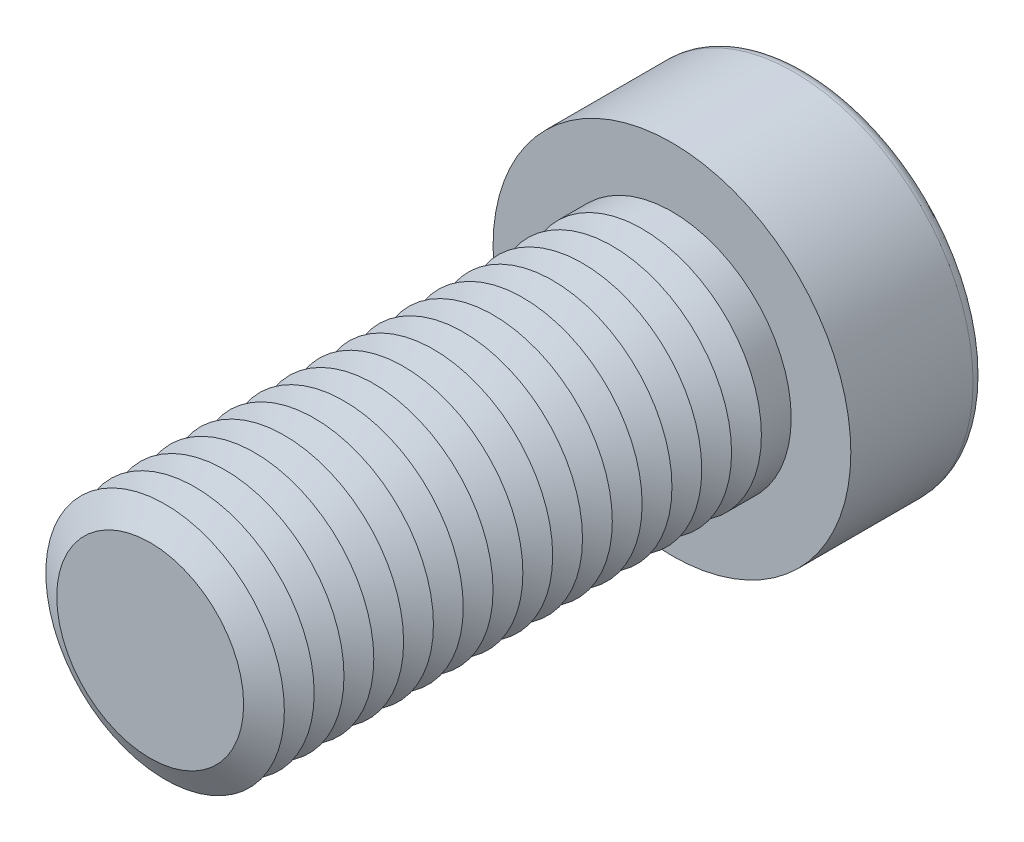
ISO-10303-21;
HEADER;
FILE_DESCRIPTION(('STEP AP214'),'2;1');
FILE_NAME('part.step','',(''),(''),'','','');
FILE_SCHEMA(('AUTOMOTIVE_DESIGN { 1 0 10303 214 1 1 1 1 }'));
ENDSEC;
DATA;
#1=APPLICATION_CONTEXT('core data for automotive mechanical design processes');
#2=APPLICATION_PROTOCOL_DEFINITION('international standard','automotive_design',2000,#1);
#3=PRODUCT_CONTEXT('',#1,'mechanical');
#4=PRODUCT('Part','Part','',(#3));
#5=PRODUCT_RELATED_PRODUCT_CATEGORY('part','',(#4));
#6=PRODUCT_DEFINITION_FORMATION('','',#4);
#7=PRODUCT_DEFINITION_CONTEXT('part definition',#1,'design');
#8=PRODUCT_DEFINITION('design','',#6,#7);
#9=PRODUCT_DEFINITION_SHAPE('','',#8);
#10=(LENGTH_UNIT() NAMED_UNIT(*) SI_UNIT(.MILLI.,.METRE.));
#11=(NAMED_UNIT(*) PLANE_ANGLE_UNIT() SI_UNIT($,.RADIAN.));
#12=(NAMED_UNIT(*) SI_UNIT($,.STERADIAN.) SOLID_ANGLE_UNIT());
#13=UNCERTAINTY_MEASURE_WITH_UNIT(LENGTH_MEASURE(1.E-05),#10,'distance_accuracy_value','');
#14=(GEOMETRIC_REPRESENTATION_CONTEXT(3) GLOBAL_UNCERTAINTY_ASSIGNED_CONTEXT((#13)) GLOBAL_UNIT_ASSIGNED_CONTEXT((#10,
#11,#12)) REPRESENTATION_CONTEXT('',''));
#15=CARTESIAN_POINT('',(0.,0.,0.));
#16=DIRECTION('',(0.,0.,1.));
#17=DIRECTION('',(1.,0.,0.));
#18=AXIS2_PLACEMENT_3D('',#15,#16,#17);
#19=CARTESIAN_POINT('',(0.,0.,28.));
#20=DIRECTION('',(0.,0.,1.));
#21=DIRECTION('',(1.,0.,0.));
#22=AXIS2_PLACEMENT_3D('',#19,#20,#21);
#23=CONICAL_SURFACE('',#22,8.,1.0471975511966);
#24=CARTESIAN_POINT('',(0.,0.,27.));
#25=DIRECTION('',(0.,0.,1.));
#26=DIRECTION('',(1.,0.,0.));
#27=AXIS2_PLACEMENT_3D('',#24,#25,#26);
#28=CIRCLE('',#27,6.26794919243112);
#29=CARTESIAN_POINT('',(6.26794919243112,0.,27.));
#30=VERTEX_POINT('',#29);
#31=EDGE_CURVE('E314',#30,#30,#28,.T.);
#32=ORIENTED_EDGE('',*,*,#31,.T.);
#33=EDGE_LOOP('',(#32));
#34=FACE_BOUND('',#33,.T.);
#35=CARTESIAN_POINT('',(0.,0.,28.));
#36=DIRECTION('',(0.,0.,1.));
#37=DIRECTION('',(1.,0.,0.));
#38=AXIS2_PLACEMENT_3D('',#35,#36,#37);
#39=CIRCLE('',#38,8.);
#40=CARTESIAN_POINT('',(8.,0.,28.));
#41=VERTEX_POINT('',#40);
#42=EDGE_CURVE('E317',#41,#41,#39,.T.);
#43=ORIENTED_EDGE('',*,*,#42,.F.);
#44=EDGE_LOOP('',(#43));
#45=FACE_BOUND('',#44,.T.);
#46=ADVANCED_FACE('F39',(#34,#45),#23,.T.);
#47=CARTESIAN_POINT('',(0.,0.,27.));
#48=DIRECTION('',(0.,0.,-1.));
#49=DIRECTION('',(-1.,0.,0.));
#50=AXIS2_PLACEMENT_3D('',#47,#48,#49);
#51=CONICAL_SURFACE('',#50,6.26794919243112,1.0471975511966);
#52=CARTESIAN_POINT('',(0.,0.,26.));
#53=DIRECTION('',(0.,0.,1.));
#54=DIRECTION('',(1.,0.,0.));
#55=AXIS2_PLACEMENT_3D('',#52,#53,#54);
#56=CIRCLE('',#55,8.);
#57=CARTESIAN_POINT('',(8.,0.,26.));
#58=VERTEX_POINT('',#57);
#59=EDGE_CURVE('E325',#58,#58,#56,.T.);
#60=ORIENTED_EDGE('',*,*,#59,.T.);
#61=EDGE_LOOP('',(#60));
#62=FACE_BOUND('',#61,.T.);
#63=ORIENTED_EDGE('',*,*,#31,.F.);
#64=EDGE_LOOP('',(#63));
#65=FACE_BOUND('',#64,.T.);
#66=ADVANCED_FACE('F245',(#62,#65),#51,.T.);
#67=CARTESIAN_POINT('',(0.,0.,35.));
#68=DIRECTION('',(0.,0.,1.));
#69=DIRECTION('',(1.,0.,0.));
#70=AXIS2_PLACEMENT_3D('',#67,#68,#69);
#71=PLANE('',#70);
#72=CARTESIAN_POINT('',(0.,0.,35.));
#73=DIRECTION('',(0.,0.,1.));
#74=DIRECTION('',(1.,0.,0.));
#75=AXIS2_PLACEMENT_3D('',#72,#73,#74);
#76=CIRCLE('',#75,6.26794919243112);
#77=CARTESIAN_POINT('',(6.26794919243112,0.,35.));
#78=VERTEX_POINT('',#77);
#79=EDGE_CURVE('E174',#78,#78,#76,.T.);
#80=ORIENTED_EDGE('',*,*,#79,.T.);
#81=EDGE_LOOP('',(#80));
#82=FACE_BOUND('',#81,.T.);
#83=ADVANCED_FACE('F251',(#82),#71,.T.);
#84=CARTESIAN_POINT('',(0.,0.,35.));
#85=DIRECTION('',(0.,0.,-1.));
#86=DIRECTION('',(-1.,0.,0.));
#87=AXIS2_PLACEMENT_3D('',#84,#85,#86);
#88=CONICAL_SURFACE('',#87,6.26794919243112,1.0471975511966);
#89=CARTESIAN_POINT('',(0.,0.,34.));
#90=DIRECTION('',(0.,0.,1.));
#91=DIRECTION('',(1.,0.,0.));
#92=AXIS2_PLACEMENT_3D('',#89,#90,#91);
#93=CIRCLE('',#92,8.);
#94=CARTESIAN_POINT('',(8.,0.,34.));
#95=VERTEX_POINT('',#94);
#96=EDGE_CURVE('E291',#95,#95,#93,.T.);
#97=ORIENTED_EDGE('',*,*,#96,.T.);
#98=EDGE_LOOP('',(#97));
#99=FACE_BOUND('',#98,.T.);
#100=ORIENTED_EDGE('',*,*,#79,.F.);
#101=EDGE_LOOP('',(#100));
#102=FACE_BOUND('',#101,.T.);
#103=ADVANCED_FACE('F199',(#99,#102),#88,.T.);
#104=CARTESIAN_POINT('',(0.,0.,34.));
#105=DIRECTION('',(0.,0.,1.));
#106=DIRECTION('',(1.,0.,0.));
#107=AXIS2_PLACEMENT_3D('',#104,#105,#106);
#108=CONICAL_SURFACE('',#107,8.,1.0471975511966);
#109=CARTESIAN_POINT('',(0.,0.,33.));
#110=DIRECTION('',(0.,0.,1.));
#111=DIRECTION('',(1.,0.,0.));
#112=AXIS2_PLACEMENT_3D('',#109,#110,#111);
#113=CIRCLE('',#112,6.26794919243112);
#114=CARTESIAN_POINT('',(6.26794919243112,0.,33.));
#115=VERTEX_POINT('',#114);
#116=EDGE_CURVE('E288',#115,#115,#113,.T.);
#117=ORIENTED_EDGE('',*,*,#116,.T.);
#118=EDGE_LOOP('',(#117));
#119=FACE_BOUND('',#118,.T.);
#120=ORIENTED_EDGE('',*,*,#96,.F.);
#121=EDGE_LOOP('',(#120));
#122=FACE_BOUND('',#121,.T.);
#123=ADVANCED_FACE('F277',(#119,#122),#108,.T.);
#124=CARTESIAN_POINT('',(0.,0.,33.));
#125=DIRECTION('',(0.,0.,-1.));
#126=DIRECTION('',(-1.,0.,0.));
#127=AXIS2_PLACEMENT_3D('',#124,#125,#126);
#128=CONICAL_SURFACE('',#127,6.26794919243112,1.0471975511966);
#129=CARTESIAN_POINT('',(0.,0.,32.));
#130=DIRECTION('',(0.,0.,1.));
#131=DIRECTION('',(1.,0.,0.));
#132=AXIS2_PLACEMENT_3D('',#129,#130,#131);
#133=CIRCLE('',#132,8.);
#134=CARTESIAN_POINT('',(8.,0.,32.));
#135=VERTEX_POINT('',#134);
#136=EDGE_CURVE('E300',#135,#135,#133,.T.);
#137=ORIENTED_EDGE('',*,*,#136,.T.);
#138=EDGE_LOOP('',(#137));
#139=FACE_BOUND('',#138,.T.);
#140=ORIENTED_EDGE('',*,*,#116,.F.);
#141=EDGE_LOOP('',(#140));
#142=FACE_BOUND('',#141,.T.);
#143=ADVANCED_FACE('F274',(#139,#142),#128,.T.);
#144=CARTESIAN_POINT('',(0.,0.,32.));
#145=DIRECTION('',(0.,0.,1.));
#146=DIRECTION('',(1.,0.,0.));
#147=AXIS2_PLACEMENT_3D('',#144,#145,#146);
#148=CONICAL_SURFACE('',#147,8.,1.0471975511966);
#149=CARTESIAN_POINT('',(0.,0.,31.));
#150=DIRECTION('',(0.,0.,1.));
#151=DIRECTION('',(1.,0.,0.));
#152=AXIS2_PLACEMENT_3D('',#149,#150,#151);
#153=CIRCLE('',#152,6.26794919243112);
#154=CARTESIAN_POINT('',(6.26794919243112,0.,31.));
#155=VERTEX_POINT('',#154);
#156=EDGE_CURVE('E293',#155,#155,#153,.T.);
#157=ORIENTED_EDGE('',*,*,#156,.T.);
#158=EDGE_LOOP('',(#157));
#159=FACE_BOUND('',#158,.T.);
#160=ORIENTED_EDGE('',*,*,#136,.F.);
#161=EDGE_LOOP('',(#160));
#162=FACE_BOUND('',#161,.T.);
#163=ADVANCED_FACE('F270',(#159,#162),#148,.T.);
#164=CARTESIAN_POINT('',(0.,0.,31.));
#165=DIRECTION('',(0.,0.,-1.));
#166=DIRECTION('',(-1.,0.,0.));
#167=AXIS2_PLACEMENT_3D('',#164,#165,#166);
#168=CONICAL_SURFACE('',#167,6.26794919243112,1.0471975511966);
#169=CARTESIAN_POINT('',(0.,0.,30.));
#170=DIRECTION('',(0.,0.,1.));
#171=DIRECTION('',(1.,0.,0.));
#172=AXIS2_PLACEMENT_3D('',#169,#170,#171);
#173=CIRCLE('',#172,8.);
#174=CARTESIAN_POINT('',(8.,0.,30.));
#175=VERTEX_POINT('',#174);
#176=EDGE_CURVE('E310',#175,#175,#173,.T.);
#177=ORIENTED_EDGE('',*,*,#176,.T.);
#178=EDGE_LOOP('',(#177));
#179=FACE_BOUND('',#178,.T.);
#180=ORIENTED_EDGE('',*,*,#156,.F.);
#181=EDGE_LOOP('',(#180));
#182=FACE_BOUND('',#181,.T.);
#183=ADVANCED_FACE('F266',(#179,#182),#168,.T.);
#184=CARTESIAN_POINT('',(0.,0.,30.));
#185=DIRECTION('',(0.,0.,1.));
#186=DIRECTION('',(1.,0.,0.));
#187=AXIS2_PLACEMENT_3D('',#184,#185,#186);
#188=CONICAL_SURFACE('',#187,8.,1.0471975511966);
#189=CARTESIAN_POINT('',(0.,0.,29.));
#190=DIRECTION('',(0.,0.,1.));
#191=DIRECTION('',(1.,0.,0.));
#192=AXIS2_PLACEMENT_3D('',#189,#190,#191);
#193=CIRCLE('',#192,6.26794919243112);
#194=CARTESIAN_POINT('',(6.26794919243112,0.,29.));
#195=VERTEX_POINT('',#194);
#196=EDGE_CURVE('E306',#195,#195,#193,.T.);
#197=ORIENTED_EDGE('',*,*,#196,.T.);
#198=EDGE_LOOP('',(#197));
#199=FACE_BOUND('',#198,.T.);
#200=ORIENTED_EDGE('',*,*,#176,.F.);
#201=EDGE_LOOP('',(#200));
#202=FACE_BOUND('',#201,.T.);
#203=ADVANCED_FACE('F262',(#199,#202),#188,.T.);
#204=CARTESIAN_POINT('',(0.,0.,29.));
#205=DIRECTION('',(0.,0.,-1.));
#206=DIRECTION('',(-1.,0.,0.));
#207=AXIS2_PLACEMENT_3D('',#204,#205,#206);
#208=CONICAL_SURFACE('',#207,6.26794919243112,1.0471975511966);
#209=ORIENTED_EDGE('',*,*,#42,.T.);
#210=EDGE_LOOP('',(#209));
#211=FACE_BOUND('',#210,.T.);
#212=ORIENTED_EDGE('',*,*,#196,.F.);
#213=EDGE_LOOP('',(#212));
#214=FACE_BOUND('',#213,.T.);
#215=ADVANCED_FACE('F258',(#211,#214),#208,.T.);
#216=CARTESIAN_POINT('',(0.,0.,26.));
#217=DIRECTION('',(0.,0.,1.));
#218=DIRECTION('',(1.,0.,0.));
#219=AXIS2_PLACEMENT_3D('',#216,#217,#218);
#220=CONICAL_SURFACE('',#219,8.,1.0471975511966);
#221=CARTESIAN_POINT('',(0.,0.,25.));
#222=DIRECTION('',(0.,0.,1.));
#223=DIRECTION('',(1.,0.,0.));
#224=AXIS2_PLACEMENT_3D('',#221,#222,#223);
#225=CIRCLE('',#224,6.26794919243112);
#226=CARTESIAN_POINT('',(6.26794919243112,0.,25.));
#227=VERTEX_POINT('',#226);
#228=EDGE_CURVE('E321',#227,#227,#225,.T.);
#229=ORIENTED_EDGE('',*,*,#228,.T.);
#230=EDGE_LOOP('',(#229));
#231=FACE_BOUND('',#230,.T.);
#232=ORIENTED_EDGE('',*,*,#59,.F.);
#233=EDGE_LOOP('',(#232));
#234=FACE_BOUND('',#233,.T.);
#235=ADVANCED_FACE('F261',(#231,#234),#220,.T.);
#236=CARTESIAN_POINT('',(0.,0.,25.));
#237=DIRECTION('',(0.,0.,-1.));
#238=DIRECTION('',(-1.,0.,0.));
#239=AXIS2_PLACEMENT_3D('',#236,#237,#238);
#240=CONICAL_SURFACE('',#239,6.26794919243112,1.0471975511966);
#241=CARTESIAN_POINT('',(0.,0.,24.));
#242=DIRECTION('',(0.,0.,1.));
#243=DIRECTION('',(1.,0.,0.));
#244=AXIS2_PLACEMENT_3D('',#241,#242,#243);
#245=CIRCLE('',#244,8.);
#246=CARTESIAN_POINT('',(8.,0.,24.));
#247=VERTEX_POINT('',#246);
#248=EDGE_CURVE('E333',#247,#247,#245,.T.);
#249=ORIENTED_EDGE('',*,*,#248,.T.);
#250=EDGE_LOOP('',(#249));
#251=FACE_BOUND('',#250,.T.);
#252=ORIENTED_EDGE('',*,*,#228,.F.);
#253=EDGE_LOOP('',(#252));
#254=FACE_BOUND('',#253,.T.);
#255=ADVANCED_FACE('F511',(#251,#254),#240,.T.);
#256=CARTESIAN_POINT('',(0.,0.,24.));
#257=DIRECTION('',(0.,0.,1.));
#258=DIRECTION('',(1.,0.,0.));
#259=AXIS2_PLACEMENT_3D('',#256,#257,#258);
#260=CONICAL_SURFACE('',#259,8.,1.0471975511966);
#261=CARTESIAN_POINT('',(0.,0.,23.));
#262=DIRECTION('',(0.,0.,1.));
#263=DIRECTION('',(1.,0.,0.));
#264=AXIS2_PLACEMENT_3D('',#261,#262,#263);
#265=CIRCLE('',#264,6.26794919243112);
#266=CARTESIAN_POINT('',(6.26794919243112,0.,23.));
#267=VERTEX_POINT('',#266);
#268=EDGE_CURVE('E329',#267,#267,#265,.T.);
#269=ORIENTED_EDGE('',*,*,#268,.T.);
#270=EDGE_LOOP('',(#269));
#271=FACE_BOUND('',#270,.T.);
#272=ORIENTED_EDGE('',*,*,#248,.F.);
#273=EDGE_LOOP('',(#272));
#274=FACE_BOUND('',#273,.T.);
#275=ADVANCED_FACE('F507',(#271,#274),#260,.T.);
#276=CARTESIAN_POINT('',(0.,0.,23.));
#277=DIRECTION('',(0.,0.,-1.));
#278=DIRECTION('',(-1.,0.,0.));
#279=AXIS2_PLACEMENT_3D('',#276,#277,#278);
#280=CONICAL_SURFACE('',#279,6.26794919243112,1.0471975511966);
#281=CARTESIAN_POINT('',(0.,0.,22.));
#282=DIRECTION('',(0.,0.,1.));
#283=DIRECTION('',(1.,0.,0.));
#284=AXIS2_PLACEMENT_3D('',#281,#282,#283);
#285=CIRCLE('',#284,8.);
#286=CARTESIAN_POINT('',(8.,0.,22.));
#287=VERTEX_POINT('',#286);
#288=EDGE_CURVE('E340',#287,#287,#285,.T.);
#289=ORIENTED_EDGE('',*,*,#288,.T.);
#290=EDGE_LOOP('',(#289));
#291=FACE_BOUND('',#290,.T.);
#292=ORIENTED_EDGE('',*,*,#268,.F.);
#293=EDGE_LOOP('',(#292));
#294=FACE_BOUND('',#293,.T.);
#295=ADVANCED_FACE('F503',(#291,#294),#280,.T.);
#296=CARTESIAN_POINT('',(0.,0.,22.));
#297=DIRECTION('',(0.,0.,1.));
#298=DIRECTION('',(1.,0.,0.));
#299=AXIS2_PLACEMENT_3D('',#296,#297,#298);
#300=CONICAL_SURFACE('',#299,8.,1.0471975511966);
#301=CARTESIAN_POINT('',(0.,0.,21.));
#302=DIRECTION('',(0.,0.,1.));
#303=DIRECTION('',(1.,0.,0.));
#304=AXIS2_PLACEMENT_3D('',#301,#302,#303);
#305=CIRCLE('',#304,6.26794919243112);
#306=CARTESIAN_POINT('',(6.26794919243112,0.,21.));
#307=VERTEX_POINT('',#306);
#308=EDGE_CURVE('E336',#307,#307,#305,.T.);
#309=ORIENTED_EDGE('',*,*,#308,.T.);
#310=EDGE_LOOP('',(#309));
#311=FACE_BOUND('',#310,.T.);
#312=ORIENTED_EDGE('',*,*,#288,.F.);
#313=EDGE_LOOP('',(#312));
#314=FACE_BOUND('',#313,.T.);
#315=ADVANCED_FACE('F499',(#311,#314),#300,.T.);
#316=CARTESIAN_POINT('',(0.,0.,21.));
#317=DIRECTION('',(0.,0.,-1.));
#318=DIRECTION('',(-1.,0.,0.));
#319=AXIS2_PLACEMENT_3D('',#316,#317,#318);
#320=CONICAL_SURFACE('',#319,6.26794919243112,1.0471975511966);
#321=CARTESIAN_POINT('',(0.,0.,20.));
#322=DIRECTION('',(0.,0.,1.));
#323=DIRECTION('',(1.,0.,0.));
#324=AXIS2_PLACEMENT_3D('',#321,#322,#323);
#325=CIRCLE('',#324,8.);
#326=CARTESIAN_POINT('',(8.,0.,20.));
#327=VERTEX_POINT('',#326);
#328=EDGE_CURVE('E348',#327,#327,#325,.T.);
#329=ORIENTED_EDGE('',*,*,#328,.T.);
#330=EDGE_LOOP('',(#329));
#331=FACE_BOUND('',#330,.T.);
#332=ORIENTED_EDGE('',*,*,#308,.F.);
#333=EDGE_LOOP('',(#332));
#334=FACE_BOUND('',#333,.T.);
#335=ADVANCED_FACE('F495',(#331,#334),#320,.T.);
#336=CARTESIAN_POINT('',(0.,0.,20.));
#337=DIRECTION('',(0.,0.,1.));
#338=DIRECTION('',(1.,0.,0.));
#339=AXIS2_PLACEMENT_3D('',#336,#337,#338);
#340=CONICAL_SURFACE('',#339,8.,1.0471975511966);
#341=CARTESIAN_POINT('',(0.,0.,19.));
#342=DIRECTION('',(0.,0.,1.));
#343=DIRECTION('',(1.,0.,0.));
#344=AXIS2_PLACEMENT_3D('',#341,#342,#343);
#345=CIRCLE('',#344,6.26794919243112);
#346=CARTESIAN_POINT('',(6.26794919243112,0.,19.));
#347=VERTEX_POINT('',#346);
#348=EDGE_CURVE('E344',#347,#347,#345,.T.);
#349=ORIENTED_EDGE('',*,*,#348,.T.);
#350=EDGE_LOOP('',(#349));
#351=FACE_BOUND('',#350,.T.);
#352=ORIENTED_EDGE('',*,*,#328,.F.);
#353=EDGE_LOOP('',(#352));
#354=FACE_BOUND('',#353,.T.);
#355=ADVANCED_FACE('F491',(#351,#354),#340,.T.);
#356=CARTESIAN_POINT('',(0.,0.,19.));
#357=DIRECTION('',(0.,0.,-1.));
#358=DIRECTION('',(-1.,0.,0.));
#359=AXIS2_PLACEMENT_3D('',#356,#357,#358);
#360=CONICAL_SURFACE('',#359,6.26794919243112,1.0471975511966);
#361=CARTESIAN_POINT('',(0.,0.,18.));
#362=DIRECTION('',(0.,0.,1.));
#363=DIRECTION('',(1.,0.,0.));
#364=AXIS2_PLACEMENT_3D('',#361,#362,#363);
#365=CIRCLE('',#364,8.);
#366=CARTESIAN_POINT('',(8.,0.,18.));
#367=VERTEX_POINT('',#366);
#368=EDGE_CURVE('E356',#367,#367,#365,.T.);
#369=ORIENTED_EDGE('',*,*,#368,.T.);
#370=EDGE_LOOP('',(#369));
#371=FACE_BOUND('',#370,.T.);
#372=ORIENTED_EDGE('',*,*,#348,.F.);
#373=EDGE_LOOP('',(#372));
#374=FACE_BOUND('',#373,.T.);
#375=ADVANCED_FACE('F487',(#371,#374),#360,.T.);
#376=CARTESIAN_POINT('',(0.,0.,18.));
#377=DIRECTION('',(0.,0.,1.));
#378=DIRECTION('',(1.,0.,0.));
#379=AXIS2_PLACEMENT_3D('',#376,#377,#378);
#380=CONICAL_SURFACE('',#379,8.,1.0471975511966);
#381=CARTESIAN_POINT('',(0.,0.,17.));
#382=DIRECTION('',(0.,0.,1.));
#383=DIRECTION('',(1.,0.,0.));
#384=AXIS2_PLACEMENT_3D('',#381,#382,#383);
#385=CIRCLE('',#384,6.26794919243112);
#386=CARTESIAN_POINT('',(6.26794919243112,0.,17.));
#387=VERTEX_POINT('',#386);
#388=EDGE_CURVE('E352',#387,#387,#385,.T.);
#389=ORIENTED_EDGE('',*,*,#388,.T.);
#390=EDGE_LOOP('',(#389));
#391=FACE_BOUND('',#390,.T.);
#392=ORIENTED_EDGE('',*,*,#368,.F.);
#393=EDGE_LOOP('',(#392));
#394=FACE_BOUND('',#393,.T.);
#395=ADVANCED_FACE('F483',(#391,#394),#380,.T.);
#396=CARTESIAN_POINT('',(0.,0.,17.));
#397=DIRECTION('',(0.,0.,-1.));
#398=DIRECTION('',(-1.,0.,0.));
#399=AXIS2_PLACEMENT_3D('',#396,#397,#398);
#400=CONICAL_SURFACE('',#399,6.26794919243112,1.0471975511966);
#401=CARTESIAN_POINT('',(0.,0.,16.));
#402=DIRECTION('',(0.,0.,1.));
#403=DIRECTION('',(1.,0.,0.));
#404=AXIS2_PLACEMENT_3D('',#401,#402,#403);
#405=CIRCLE('',#404,8.);
#406=CARTESIAN_POINT('',(8.,0.,16.));
#407=VERTEX_POINT('',#406);
#408=EDGE_CURVE('E364',#407,#407,#405,.T.);
#409=ORIENTED_EDGE('',*,*,#408,.T.);
#410=EDGE_LOOP('',(#409));
#411=FACE_BOUND('',#410,.T.);
#412=ORIENTED_EDGE('',*,*,#388,.F.);
#413=EDGE_LOOP('',(#412));
#414=FACE_BOUND('',#413,.T.);
#415=ADVANCED_FACE('F479',(#411,#414),#400,.T.);
#416=CARTESIAN_POINT('',(0.,0.,16.));
#417=DIRECTION('',(0.,0.,1.));
#418=DIRECTION('',(1.,0.,0.));
#419=AXIS2_PLACEMENT_3D('',#416,#417,#418);
#420=CONICAL_SURFACE('',#419,8.,1.0471975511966);
#421=CARTESIAN_POINT('',(0.,0.,15.));
#422=DIRECTION('',(0.,0.,1.));
#423=DIRECTION('',(1.,0.,0.));
#424=AXIS2_PLACEMENT_3D('',#421,#422,#423);
#425=CIRCLE('',#424,6.26794919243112);
#426=CARTESIAN_POINT('',(6.26794919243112,0.,15.));
#427=VERTEX_POINT('',#426);
#428=EDGE_CURVE('E360',#427,#427,#425,.T.);
#429=ORIENTED_EDGE('',*,*,#428,.T.);
#430=EDGE_LOOP('',(#429));
#431=FACE_BOUND('',#430,.T.);
#432=ORIENTED_EDGE('',*,*,#408,.F.);
#433=EDGE_LOOP('',(#432));
#434=FACE_BOUND('',#433,.T.);
#435=ADVANCED_FACE('F475',(#431,#434),#420,.T.);
#436=CARTESIAN_POINT('',(0.,0.,15.));
#437=DIRECTION('',(0.,0.,-1.));
#438=DIRECTION('',(-1.,0.,0.));
#439=AXIS2_PLACEMENT_3D('',#436,#437,#438);
#440=CONICAL_SURFACE('',#439,6.26794919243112,1.0471975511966);
#441=CARTESIAN_POINT('',(0.,0.,14.));
#442=DIRECTION('',(0.,0.,1.));
#443=DIRECTION('',(1.,0.,0.));
#444=AXIS2_PLACEMENT_3D('',#441,#442,#443);
#445=CIRCLE('',#444,8.);
#446=CARTESIAN_POINT('',(8.,0.,14.));
#447=VERTEX_POINT('',#446);
#448=EDGE_CURVE('E372',#447,#447,#445,.T.);
#449=ORIENTED_EDGE('',*,*,#448,.T.);
#450=EDGE_LOOP('',(#449));
#451=FACE_BOUND('',#450,.T.);
#452=ORIENTED_EDGE('',*,*,#428,.F.);
#453=EDGE_LOOP('',(#452));
#454=FACE_BOUND('',#453,.T.);
#455=ADVANCED_FACE('F471',(#451,#454),#440,.T.);
#456=CARTESIAN_POINT('',(0.,0.,14.));
#457=DIRECTION('',(0.,0.,1.));
#458=DIRECTION('',(1.,0.,0.));
#459=AXIS2_PLACEMENT_3D('',#456,#457,#458);
#460=CONICAL_SURFACE('',#459,8.,1.0471975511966);
#461=CARTESIAN_POINT('',(0.,0.,13.));
#462=DIRECTION('',(0.,0.,1.));
#463=DIRECTION('',(1.,0.,0.));
#464=AXIS2_PLACEMENT_3D('',#461,#462,#463);
#465=CIRCLE('',#464,6.26794919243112);
#466=CARTESIAN_POINT('',(6.26794919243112,0.,13.));
#467=VERTEX_POINT('',#466);
#468=EDGE_CURVE('E368',#467,#467,#465,.T.);
#469=ORIENTED_EDGE('',*,*,#468,.T.);
#470=EDGE_LOOP('',(#469));
#471=FACE_BOUND('',#470,.T.);
#472=ORIENTED_EDGE('',*,*,#448,.F.);
#473=EDGE_LOOP('',(#472));
#474=FACE_BOUND('',#473,.T.);
#475=ADVANCED_FACE('F467',(#471,#474),#460,.T.);
#476=CARTESIAN_POINT('',(0.,0.,13.));
#477=DIRECTION('',(0.,0.,-1.));
#478=DIRECTION('',(-1.,0.,0.));
#479=AXIS2_PLACEMENT_3D('',#476,#477,#478);
#480=CONICAL_SURFACE('',#479,6.26794919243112,1.0471975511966);
#481=CARTESIAN_POINT('',(0.,0.,12.));
#482=DIRECTION('',(0.,0.,1.));
#483=DIRECTION('',(1.,0.,0.));
#484=AXIS2_PLACEMENT_3D('',#481,#482,#483);
#485=CIRCLE('',#484,8.);
#486=CARTESIAN_POINT('',(8.,0.,12.));
#487=VERTEX_POINT('',#486);
#488=EDGE_CURVE('E380',#487,#487,#485,.T.);
#489=ORIENTED_EDGE('',*,*,#488,.T.);
#490=EDGE_LOOP('',(#489));
#491=FACE_BOUND('',#490,.T.);
#492=ORIENTED_EDGE('',*,*,#468,.F.);
#493=EDGE_LOOP('',(#492));
#494=FACE_BOUND('',#493,.T.);
#495=ADVANCED_FACE('F463',(#491,#494),#480,.T.);
#496=CARTESIAN_POINT('',(0.,0.,12.));
#497=DIRECTION('',(0.,0.,1.));
#498=DIRECTION('',(1.,0.,0.));
#499=AXIS2_PLACEMENT_3D('',#496,#497,#498);
#500=CONICAL_SURFACE('',#499,8.,1.0471975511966);
#501=CARTESIAN_POINT('',(0.,0.,11.));
#502=DIRECTION('',(0.,0.,1.));
#503=DIRECTION('',(1.,0.,0.));
#504=AXIS2_PLACEMENT_3D('',#501,#502,#503);
#505=CIRCLE('',#504,6.26794919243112);
#506=CARTESIAN_POINT('',(6.26794919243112,0.,11.));
#507=VERTEX_POINT('',#506);
#508=EDGE_CURVE('E376',#507,#507,#505,.T.);
#509=ORIENTED_EDGE('',*,*,#508,.T.);
#510=EDGE_LOOP('',(#509));
#511=FACE_BOUND('',#510,.T.);
#512=ORIENTED_EDGE('',*,*,#488,.F.);
#513=EDGE_LOOP('',(#512));
#514=FACE_BOUND('',#513,.T.);
#515=ADVANCED_FACE('F459',(#511,#514),#500,.T.);
#516=CARTESIAN_POINT('',(0.,0.,11.));
#517=DIRECTION('',(0.,0.,-1.));
#518=DIRECTION('',(-1.,0.,0.));
#519=AXIS2_PLACEMENT_3D('',#516,#517,#518);
#520=CONICAL_SURFACE('',#519,6.26794919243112,1.0471975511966);
#521=CARTESIAN_POINT('',(0.,0.,10.));
#522=DIRECTION('',(0.,0.,1.));
#523=DIRECTION('',(1.,0.,0.));
#524=AXIS2_PLACEMENT_3D('',#521,#522,#523);
#525=CIRCLE('',#524,8.);
#526=CARTESIAN_POINT('',(8.,0.,10.));
#527=VERTEX_POINT('',#526);
#528=EDGE_CURVE('E388',#527,#527,#525,.T.);
#529=ORIENTED_EDGE('',*,*,#528,.T.);
#530=EDGE_LOOP('',(#529));
#531=FACE_BOUND('',#530,.T.);
#532=ORIENTED_EDGE('',*,*,#508,.F.);
#533=EDGE_LOOP('',(#532));
#534=FACE_BOUND('',#533,.T.);
#535=ADVANCED_FACE('F455',(#531,#534),#520,.T.);
#536=CARTESIAN_POINT('',(0.,0.,10.));
#537=DIRECTION('',(0.,0.,1.));
#538=DIRECTION('',(1.,0.,0.));
#539=AXIS2_PLACEMENT_3D('',#536,#537,#538);
#540=CONICAL_SURFACE('',#539,8.,1.0471975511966);
#541=CARTESIAN_POINT('',(0.,0.,9.));
#542=DIRECTION('',(0.,0.,1.));
#543=DIRECTION('',(1.,0.,0.));
#544=AXIS2_PLACEMENT_3D('',#541,#542,#543);
#545=CIRCLE('',#544,6.26794919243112);
#546=CARTESIAN_POINT('',(6.26794919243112,0.,9.));
#547=VERTEX_POINT('',#546);
#548=EDGE_CURVE('E384',#547,#547,#545,.T.);
#549=ORIENTED_EDGE('',*,*,#548,.T.);
#550=EDGE_LOOP('',(#549));
#551=FACE_BOUND('',#550,.T.);
#552=ORIENTED_EDGE('',*,*,#528,.F.);
#553=EDGE_LOOP('',(#552));
#554=FACE_BOUND('',#553,.T.);
#555=ADVANCED_FACE('F451',(#551,#554),#540,.T.);
#556=CARTESIAN_POINT('',(0.,0.,9.));
#557=DIRECTION('',(0.,0.,-1.));
#558=DIRECTION('',(-1.,0.,0.));
#559=AXIS2_PLACEMENT_3D('',#556,#557,#558);
#560=CONICAL_SURFACE('',#559,6.26794919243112,1.0471975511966);
#561=CARTESIAN_POINT('',(0.,0.,8.));
#562=DIRECTION('',(0.,0.,1.));
#563=DIRECTION('',(1.,0.,0.));
#564=AXIS2_PLACEMENT_3D('',#561,#562,#563);
#565=CIRCLE('',#564,8.);
#566=CARTESIAN_POINT('',(8.,0.,8.));
#567=VERTEX_POINT('',#566);
#568=EDGE_CURVE('E396',#567,#567,#565,.T.);
#569=ORIENTED_EDGE('',*,*,#568,.T.);
#570=EDGE_LOOP('',(#569));
#571=FACE_BOUND('',#570,.T.);
#572=ORIENTED_EDGE('',*,*,#548,.F.);
#573=EDGE_LOOP('',(#572));
#574=FACE_BOUND('',#573,.T.);
#575=ADVANCED_FACE('F447',(#571,#574),#560,.T.);
#576=CARTESIAN_POINT('',(0.,0.,8.));
#577=DIRECTION('',(0.,0.,1.));
#578=DIRECTION('',(1.,0.,0.));
#579=AXIS2_PLACEMENT_3D('',#576,#577,#578);
#580=CONICAL_SURFACE('',#579,8.,1.0471975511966);
#581=CARTESIAN_POINT('',(0.,0.,7.));
#582=DIRECTION('',(0.,0.,1.));
#583=DIRECTION('',(1.,0.,0.));
#584=AXIS2_PLACEMENT_3D('',#581,#582,#583);
#585=CIRCLE('',#584,6.26794919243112);
#586=CARTESIAN_POINT('',(6.26794919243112,0.,7.));
#587=VERTEX_POINT('',#586);
#588=EDGE_CURVE('E392',#587,#587,#585,.T.);
#589=ORIENTED_EDGE('',*,*,#588,.T.);
#590=EDGE_LOOP('',(#589));
#591=FACE_BOUND('',#590,.T.);
#592=ORIENTED_EDGE('',*,*,#568,.F.);
#593=EDGE_LOOP('',(#592));
#594=FACE_BOUND('',#593,.T.);
#595=ADVANCED_FACE('F443',(#591,#594),#580,.T.);
#596=CARTESIAN_POINT('',(0.,0.,7.));
#597=DIRECTION('',(0.,0.,-1.));
#598=DIRECTION('',(-1.,0.,0.));
#599=AXIS2_PLACEMENT_3D('',#596,#597,#598);
#600=CONICAL_SURFACE('',#599,6.26794919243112,1.0471975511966);
#601=CARTESIAN_POINT('',(0.,0.,6.00000000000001));
#602=DIRECTION('',(0.,0.,1.));
#603=DIRECTION('',(1.,0.,0.));
#604=AXIS2_PLACEMENT_3D('',#601,#602,#603);
#605=CIRCLE('',#604,8.);
#606=CARTESIAN_POINT('',(8.,0.,6.00000000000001));
#607=VERTEX_POINT('',#606);
#608=EDGE_CURVE('E404',#607,#607,#605,.T.);
#609=ORIENTED_EDGE('',*,*,#608,.T.);
#610=EDGE_LOOP('',(#609));
#611=FACE_BOUND('',#610,.T.);
#612=ORIENTED_EDGE('',*,*,#588,.F.);
#613=EDGE_LOOP('',(#612));
#614=FACE_BOUND('',#613,.T.);
#615=ADVANCED_FACE('F439',(#611,#614),#600,.T.);
#616=CARTESIAN_POINT('',(0.,0.,6.00000000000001));
#617=DIRECTION('',(0.,0.,1.));
#618=DIRECTION('',(1.,0.,0.));
#619=AXIS2_PLACEMENT_3D('',#616,#617,#618);
#620=CONICAL_SURFACE('',#619,8.,1.0471975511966);
#621=CARTESIAN_POINT('',(0.,0.,5.));
#622=DIRECTION('',(0.,0.,1.));
#623=DIRECTION('',(1.,0.,0.));
#624=AXIS2_PLACEMENT_3D('',#621,#622,#623);
#625=CIRCLE('',#624,6.26794919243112);
#626=CARTESIAN_POINT('',(6.26794919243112,0.,5.));
#627=VERTEX_POINT('',#626);
#628=EDGE_CURVE('E400',#627,#627,#625,.T.);
#629=ORIENTED_EDGE('',*,*,#628,.T.);
#630=EDGE_LOOP('',(#629));
#631=FACE_BOUND('',#630,.T.);
#632=ORIENTED_EDGE('',*,*,#608,.F.);
#633=EDGE_LOOP('',(#632));
#634=FACE_BOUND('',#633,.T.);
#635=ADVANCED_FACE('F434',(#631,#634),#620,.T.);
#636=CARTESIAN_POINT('',(0.,0.,5.));
#637=DIRECTION('',(0.,0.,-1.));
#638=DIRECTION('',(-1.,0.,0.));
#639=AXIS2_PLACEMENT_3D('',#636,#637,#638);
#640=CONICAL_SURFACE('',#639,6.26794919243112,1.0471975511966);
#641=CARTESIAN_POINT('',(0.,0.,4.));
#642=DIRECTION('',(0.,0.,1.));
#643=DIRECTION('',(1.,0.,0.));
#644=AXIS2_PLACEMENT_3D('',#641,#642,#643);
#645=CIRCLE('',#644,8.);
#646=CARTESIAN_POINT('',(8.,0.,4.));
#647=VERTEX_POINT('',#646);
#648=EDGE_CURVE('E415',#647,#647,#645,.T.);
#649=ORIENTED_EDGE('',*,*,#648,.T.);
#650=EDGE_LOOP('',(#649));
#651=FACE_BOUND('',#650,.T.);
#652=ORIENTED_EDGE('',*,*,#628,.F.);
#653=EDGE_LOOP('',(#652));
#654=FACE_BOUND('',#653,.T.);
#655=ADVANCED_FACE('F420',(#651,#654),#640,.T.);
#656=CARTESIAN_POINT('',(0.,0.,4.));
#657=DIRECTION('',(0.,0.,1.));
#658=DIRECTION('',(1.,0.,0.));
#659=AXIS2_PLACEMENT_3D('',#656,#657,#658);
#660=CONICAL_SURFACE('',#659,8.,1.0471975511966);
#661=CARTESIAN_POINT('',(0.,0.,3.));
#662=DIRECTION('',(0.,0.,1.));
#663=DIRECTION('',(1.,0.,0.));
#664=AXIS2_PLACEMENT_3D('',#661,#662,#663);
#665=CIRCLE('',#664,6.26794919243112);
#666=CARTESIAN_POINT('',(6.26794919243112,0.,3.));
#667=VERTEX_POINT('',#666);
#668=EDGE_CURVE('E408',#667,#667,#665,.T.);
#669=ORIENTED_EDGE('',*,*,#668,.T.);
#670=EDGE_LOOP('',(#669));
#671=FACE_BOUND('',#670,.T.);
#672=ORIENTED_EDGE('',*,*,#648,.F.);
#673=EDGE_LOOP('',(#672));
#674=FACE_BOUND('',#673,.T.);
#675=ADVANCED_FACE('F423',(#671,#674),#660,.T.);
#676=CARTESIAN_POINT('',(0.,0.,3.));
#677=DIRECTION('',(0.,0.,-1.));
#678=DIRECTION('',(-1.,0.,0.));
#679=AXIS2_PLACEMENT_3D('',#676,#677,#678);
#680=CONICAL_SURFACE('',#679,6.26794919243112,1.0471975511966);
#681=CARTESIAN_POINT('',(0.,0.,2.));
#682=DIRECTION('',(0.,0.,1.));
#683=DIRECTION('',(1.,0.,0.));
#684=AXIS2_PLACEMENT_3D('',#681,#682,#683);
#685=CIRCLE('',#684,8.);
#686=CARTESIAN_POINT('',(8.,0.,2.));
#687=VERTEX_POINT('',#686);
#688=EDGE_CURVE('E411',#687,#687,#685,.T.);
#689=ORIENTED_EDGE('',*,*,#688,.T.);
#690=EDGE_LOOP('',(#689));
#691=FACE_BOUND('',#690,.T.);
#692=ORIENTED_EDGE('',*,*,#668,.F.);
#693=EDGE_LOOP('',(#692));
#694=FACE_BOUND('',#693,.T.);
#695=ADVANCED_FACE('F425',(#691,#694),#680,.T.);
#696=CARTESIAN_POINT('',(0.,0.,0.));
#697=DIRECTION('',(0.,0.,-1.));
#698=DIRECTION('',(-1.,0.,0.));
#699=AXIS2_PLACEMENT_3D('',#696,#697,#698);
#700=CONICAL_SURFACE('',#699,6.,1.0471975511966);
#701=CARTESIAN_POINT('',(0.,0.,3.46410161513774));
#702=VERTEX_POINT('',#701);
#703=VERTEX_LOOP('',#702);
#704=FACE_BOUND('',#703,.T.);
#705=CARTESIAN_POINT('',(0.,0.,0.));
#706=DIRECTION('',(0.,0.,-1.));
#707=DIRECTION('',(-1.,0.,0.));
#708=AXIS2_PLACEMENT_3D('',#705,#706,#707);
#709=CIRCLE('',#708,6.);
#710=CARTESIAN_POINT('',(-5.19615242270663,3.,0.));
#711=VERTEX_POINT('',#710);
#712=CARTESIAN_POINT('',(0.,6.,0.));
#713=VERTEX_POINT('',#712);
#714=EDGE_CURVE('E149',#711,#713,#709,.T.);
#715=ORIENTED_EDGE('',*,*,#714,.T.);
#716=CARTESIAN_POINT('',(0.,0.,0.));
#717=DIRECTION('',(0.,0.,-1.));
#718=DIRECTION('',(-1.,0.,0.));
#719=AXIS2_PLACEMENT_3D('',#716,#717,#718);
#720=CIRCLE('',#719,6.);
#721=CARTESIAN_POINT('',(5.19615242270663,3.,0.));
#722=VERTEX_POINT('',#721);
#723=EDGE_CURVE('E54',#713,#722,#720,.T.);
#724=ORIENTED_EDGE('',*,*,#723,.T.);
#725=CARTESIAN_POINT('',(5.19615242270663,-3.,0.));
#726=VERTEX_POINT('',#725);
#727=EDGE_CURVE('E1025',#722,#726,#720,.T.);
#728=ORIENTED_EDGE('',*,*,#727,.T.);
#729=CARTESIAN_POINT('',(0.,-6.,0.));
#730=VERTEX_POINT('',#729);
#731=EDGE_CURVE('E1024',#726,#730,#720,.T.);
#732=ORIENTED_EDGE('',*,*,#731,.T.);
#733=CARTESIAN_POINT('',(-5.19615242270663,-3.,0.));
#734=VERTEX_POINT('',#733);
#735=EDGE_CURVE('E1018',#730,#734,#720,.T.);
#736=ORIENTED_EDGE('',*,*,#735,.T.);
#737=EDGE_CURVE('E1016',#734,#711,#720,.T.);
#738=ORIENTED_EDGE('',*,*,#737,.T.);
#739=EDGE_LOOP('',(#715,#724,#728,#732,#736,#738));
#740=FACE_BOUND('',#739,.T.);
#741=ADVANCED_FACE('F201',(#704,#740),#700,.F.);
#742=CARTESIAN_POINT('',(0.,0.,0.));
#743=DIRECTION('',(0.,0.,-1.));
#744=DIRECTION('',(-1.,0.,0.));
#745=AXIS2_PLACEMENT_3D('',#742,#743,#744);
#746=PLANE('',#745);
#747=ORIENTED_EDGE('',*,*,#723,.F.);
#748=DIRECTION('',(1.,0.,0.));
#749=VECTOR('',#748,1.);
#750=CARTESIAN_POINT('',(-3.46410161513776,6.,0.));
#751=LINE('',#750,#749);
#752=CARTESIAN_POINT('',(3.46410161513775,6.,0.));
#753=VERTEX_POINT('',#752);
#754=EDGE_CURVE('E1064',#713,#753,#751,.T.);
#755=ORIENTED_EDGE('',*,*,#754,.T.);
#756=DIRECTION('',(0.5,-0.866025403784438,0.));
#757=VECTOR('',#756,1.);
#758=CARTESIAN_POINT('',(3.46410161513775,6.,0.));
#759=LINE('',#758,#757);
#760=EDGE_CURVE('E155',#753,#722,#759,.T.);
#761=ORIENTED_EDGE('',*,*,#760,.T.);
#762=EDGE_LOOP('',(#747,#755,#761));
#763=FACE_BOUND('',#762,.T.);
#764=ADVANCED_FACE('F606',(#763),#746,.T.);
#765=ORIENTED_EDGE('',*,*,#727,.F.);
#766=CARTESIAN_POINT('',(6.92820323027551,0.,0.));
#767=VERTEX_POINT('',#766);
#768=EDGE_CURVE('E1068',#722,#767,#759,.T.);
#769=ORIENTED_EDGE('',*,*,#768,.T.);
#770=DIRECTION('',(-0.5,-0.866025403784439,0.));
#771=VECTOR('',#770,1.);
#772=CARTESIAN_POINT('',(6.92820323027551,0.,0.));
#773=LINE('',#772,#771);
#774=EDGE_CURVE('E1039',#767,#726,#773,.T.);
#775=ORIENTED_EDGE('',*,*,#774,.T.);
#776=EDGE_LOOP('',(#765,#769,#775));
#777=FACE_BOUND('',#776,.T.);
#778=ADVANCED_FACE('F616',(#777),#746,.T.);
#779=ORIENTED_EDGE('',*,*,#731,.F.);
#780=CARTESIAN_POINT('',(3.46410161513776,-6.,0.));
#781=VERTEX_POINT('',#780);
#782=EDGE_CURVE('E1041',#726,#781,#773,.T.);
#783=ORIENTED_EDGE('',*,*,#782,.T.);
#784=DIRECTION('',(-1.,0.,0.));
#785=VECTOR('',#784,1.);
#786=CARTESIAN_POINT('',(3.46410161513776,-6.,0.));
#787=LINE('',#786,#785);
#788=EDGE_CURVE('E992',#781,#730,#787,.T.);
#789=ORIENTED_EDGE('',*,*,#788,.T.);
#790=EDGE_LOOP('',(#779,#783,#789));
#791=FACE_BOUND('',#790,.T.);
#792=ADVANCED_FACE('F626',(#791),#746,.T.);
#793=ORIENTED_EDGE('',*,*,#735,.F.);
#794=CARTESIAN_POINT('',(-3.46410161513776,-6.,0.));
#795=VERTEX_POINT('',#794);
#796=EDGE_CURVE('E1035',#730,#795,#787,.T.);
#797=ORIENTED_EDGE('',*,*,#796,.T.);
#798=DIRECTION('',(-0.5,0.866025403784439,0.));
#799=VECTOR('',#798,1.);
#800=CARTESIAN_POINT('',(-3.46410161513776,-6.,0.));
#801=LINE('',#800,#799);
#802=EDGE_CURVE('E1037',#795,#734,#801,.T.);
#803=ORIENTED_EDGE('',*,*,#802,.T.);
#804=EDGE_LOOP('',(#793,#797,#803));
#805=FACE_BOUND('',#804,.T.);
#806=ADVANCED_FACE('F634',(#805),#746,.T.);
#807=ORIENTED_EDGE('',*,*,#737,.F.);
#808=CARTESIAN_POINT('',(-6.92820323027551,0.,0.));
#809=VERTEX_POINT('',#808);
#810=EDGE_CURVE('E1042',#734,#809,#801,.T.);
#811=ORIENTED_EDGE('',*,*,#810,.T.);
#812=DIRECTION('',(0.5,0.866025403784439,0.));
#813=VECTOR('',#812,1.);
#814=CARTESIAN_POINT('',(-6.92820323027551,0.,0.));
#815=LINE('',#814,#813);
#816=EDGE_CURVE('E158',#809,#711,#815,.T.);
#817=ORIENTED_EDGE('',*,*,#816,.T.);
#818=EDGE_LOOP('',(#807,#811,#817));
#819=FACE_BOUND('',#818,.T.);
#820=ADVANCED_FACE('F231',(#819),#746,.T.);
#821=ORIENTED_EDGE('',*,*,#714,.F.);
#822=CARTESIAN_POINT('',(-3.46410161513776,6.,0.));
#823=VERTEX_POINT('',#822);
#824=EDGE_CURVE('E1048',#711,#823,#815,.T.);
#825=ORIENTED_EDGE('',*,*,#824,.T.);
#826=EDGE_CURVE('E1063',#823,#713,#751,.T.);
#827=ORIENTED_EDGE('',*,*,#826,.T.);
#828=EDGE_LOOP('',(#821,#825,#827));
#829=FACE_BOUND('',#828,.T.);
#830=ADVANCED_FACE('F618',(#829),#746,.T.);
#831=CARTESIAN_POINT('',(-3.46410161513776,6.,0.));
#832=DIRECTION('',(0.,1.,0.));
#833=DIRECTION('',(0.,0.,1.));
#834=AXIS2_PLACEMENT_3D('',#831,#832,#833);
#835=PLANE('',#834);
#836=DIRECTION('',(0.,0.,-1.));
#837=VECTOR('',#836,1.);
#838=CARTESIAN_POINT('',(-3.46410161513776,6.,0.));
#839=LINE('',#838,#837);
#840=CARTESIAN_POINT('',(-3.46410161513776,6.,-9.));
#841=VERTEX_POINT('',#840);
#842=EDGE_CURVE('E147',#823,#841,#839,.T.);
#843=ORIENTED_EDGE('',*,*,#842,.T.);
#844=CARTESIAN_POINT('',(-9.04322275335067,6.,-10.0515506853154));
#845=CARTESIAN_POINT('',(-8.77229389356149,6.,-9.99107568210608));
#846=CARTESIAN_POINT('',(-8.50119215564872,6.,-9.93136093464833));
#847=CARTESIAN_POINT('',(-7.95855825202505,6.,-9.81386229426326));
#848=CARTESIAN_POINT('',(-7.68702606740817,6.,-9.75607848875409));
#849=CARTESIAN_POINT('',(-7.14318995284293,6.,-9.64279905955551));
#850=CARTESIAN_POINT('',(-6.87088551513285,6.,-9.58730586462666));
#851=CARTESIAN_POINT('',(-6.32570082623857,6.,-9.47922577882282));
#852=CARTESIAN_POINT('',(-6.05282058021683,6.,-9.42663886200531));
#853=CARTESIAN_POINT('',(-5.50875458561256,6.,-9.32550177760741));
#854=CARTESIAN_POINT('',(-5.23757463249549,6.,-9.27692059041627));
#855=CARTESIAN_POINT('',(-4.69446863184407,6.,-9.18413302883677));
#856=CARTESIAN_POINT('',(-4.42254260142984,6.,-9.13992655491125));
#857=CARTESIAN_POINT('',(-3.87790333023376,6.,-9.05690830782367));
#858=CARTESIAN_POINT('',(-3.6051902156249,6.,-9.0180957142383));
#859=CARTESIAN_POINT('',(-3.05890080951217,6.,-8.94703062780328));
#860=CARTESIAN_POINT('',(-2.7853245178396,6.,-8.91477813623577));
#861=CARTESIAN_POINT('',(-2.23425545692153,6.,-8.85776959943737));
#862=CARTESIAN_POINT('',(-1.95675335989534,6.,-8.83310236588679));
#863=CARTESIAN_POINT('',(-1.40107824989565,6.,-8.79298360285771));
#864=CARTESIAN_POINT('',(-1.12290525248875,6.,-8.77753186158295));
#865=CARTESIAN_POINT('',(-0.566293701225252,6.,-8.75674610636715));
#866=CARTESIAN_POINT('',(-0.28785531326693,6.,-8.75140773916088));
#867=CARTESIAN_POINT('',(0.269026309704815,6.,-8.75117360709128));
#868=CARTESIAN_POINT('',(0.547469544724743,6.,-8.75627785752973));
#869=CARTESIAN_POINT('',(1.10511819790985,6.,-8.77664719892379));
#870=CARTESIAN_POINT('',(1.38432206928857,6.,-8.79195380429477));
#871=CARTESIAN_POINT('',(1.94205759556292,6.,-8.83187108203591));
#872=CARTESIAN_POINT('',(2.22058923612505,6.,-8.85648195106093));
#873=CARTESIAN_POINT('',(2.77698779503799,6.,-8.91379497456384));
#874=CARTESIAN_POINT('',(3.0548541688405,6.,-8.94650233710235));
#875=CARTESIAN_POINT('',(3.60969614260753,6.,-9.01868375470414));
#876=CARTESIAN_POINT('',(3.8866717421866,6.,-9.0581578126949));
#877=CARTESIAN_POINT('',(4.44700464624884,6.,-9.14374886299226));
#878=CARTESIAN_POINT('',(4.73033933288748,6.,-9.190012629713));
#879=CARTESIAN_POINT('',(5.29620685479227,6.,-9.28723184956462));
#880=CARTESIAN_POINT('',(5.57873966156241,6.,-9.3381874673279));
#881=CARTESIAN_POINT('',(6.14313105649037,6.,-9.44386031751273));
#882=CARTESIAN_POINT('',(6.42498956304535,6.,-9.49857798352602));
#883=CARTESIAN_POINT('',(6.98810511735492,6.,-9.61103289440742));
#884=CARTESIAN_POINT('',(7.26936215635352,6.,-9.66877018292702));
#885=CARTESIAN_POINT('',(8.11254995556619,6.,-9.84563705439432));
#886=CARTESIAN_POINT('',(8.67372006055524,6.,-9.96838761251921));
#887=CARTESIAN_POINT('',(9.79457370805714,6.,-10.2202420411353));
#888=CARTESIAN_POINT('',(10.3542573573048,6.,-10.3493454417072));
#889=CARTESIAN_POINT('',(11.4657945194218,6.,-10.6103395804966));
#890=CARTESIAN_POINT('',(12.0176605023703,6.,-10.7421773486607));
#891=CARTESIAN_POINT('',(13.1206665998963,6.,-11.0089002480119));
#892=CARTESIAN_POINT('',(13.6718066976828,6.,-11.1437854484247));
#893=CARTESIAN_POINT('',(14.7727697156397,6.,-11.4155878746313));
#894=CARTESIAN_POINT('',(15.3225934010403,6.,-11.5525020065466));
#895=CARTESIAN_POINT('',(16.4217957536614,6.,-11.8280226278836));
#896=CARTESIAN_POINT('',(16.971174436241,6.,-11.9666290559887));
#897=CARTESIAN_POINT('',(17.5204019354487,6.,-12.1058251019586));
#898=B_SPLINE_CURVE_WITH_KNOTS('',3,(#844,#845,#846,#847,#848,#849,#850,#851,#852,#853,#854,
#855,#856,#857,#858,#859,#860,#861,#862,#863,#864,#865,#866,#867,#868,#869,#870,#871,#872,#873,
#874,#875,#876,#877,#878,#879,#880,#881,#882,#883,#884,#885,#886,#887,#888,#889,#890,#891,#892,
#893,#894,#895,#896,#897),.UNSPECIFIED.,.F.,.F.,(4,2,2,2,2,2,2,2,2,2,2,2,2,2,2,2,2,2,2,2,2,2,2,
2,2,2,4),(0.,0.832792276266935,1.6656222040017,2.49931362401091,3.33299760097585,
4.15946050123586,4.98590459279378,5.81222284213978,6.63854125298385,7.47419540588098,
8.30983035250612,9.14510552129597,9.98038191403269,10.8190780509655,11.6577919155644,
12.4970466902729,13.336301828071,14.1975135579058,15.0587555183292,15.9200969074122,
16.7814507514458,18.5047000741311,20.2278221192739,21.929995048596,23.6322066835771,
25.3320460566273,27.0318240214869),.UNSPECIFIED.);
#899=CARTESIAN_POINT('',(3.46410161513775,6.,-9.));
#900=VERTEX_POINT('',#899);
#901=EDGE_CURVE('E124',#841,#900,#898,.T.);
#902=ORIENTED_EDGE('',*,*,#901,.T.);
#903=DIRECTION('',(0.,0.,-1.));
#904=VECTOR('',#903,1.);
#905=CARTESIAN_POINT('',(3.46410161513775,6.,0.));
#906=LINE('',#905,#904);
#907=EDGE_CURVE('E143',#753,#900,#906,.T.);
#908=ORIENTED_EDGE('',*,*,#907,.F.);
#909=ORIENTED_EDGE('',*,*,#754,.F.);
#910=ORIENTED_EDGE('',*,*,#826,.F.);
#911=EDGE_LOOP('',(#843,#902,#908,#909,#910));
#912=FACE_BOUND('',#911,.T.);
#913=ADVANCED_FACE('F141',(#912),#835,.F.);
#914=CARTESIAN_POINT('',(3.46410161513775,6.,0.));
#915=DIRECTION('',(0.866025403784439,0.5,0.));
#916=DIRECTION('',(-0.5,0.866025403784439,0.));
#917=AXIS2_PLACEMENT_3D('',#914,#915,#916);
#918=PLANE('',#917);
#919=ORIENTED_EDGE('',*,*,#907,.T.);
#920=CARTESIAN_POINT('',(3.46398614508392,6.0002,-9.00003094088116));
#921=CARTESIAN_POINT('',(3.60785114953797,5.75101850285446,-8.96146591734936));
#922=CARTESIAN_POINT('',(3.75197700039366,5.5013852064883,-8.92645521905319));
#923=CARTESIAN_POINT('',(4.0407377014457,5.00123700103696,-8.86494467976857));
#924=CARTESIAN_POINT('',(4.18537273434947,4.75072177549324,-8.83844829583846));
#925=CARTESIAN_POINT('',(4.47427486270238,4.25032861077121,-8.79551324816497));
#926=CARTESIAN_POINT('',(4.61854000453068,4.00045405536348,-8.77902338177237));
#927=CARTESIAN_POINT('',(4.90725426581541,3.5003862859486,-8.75691215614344));
#928=CARTESIAN_POINT('',(5.05170334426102,3.2501931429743,-8.75128869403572));
#929=CARTESIAN_POINT('',(5.34060150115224,2.7498068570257,-8.75128869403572));
#930=CARTESIAN_POINT('',(5.48505057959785,2.49961371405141,-8.75691215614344));
#931=CARTESIAN_POINT('',(5.77376484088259,1.99954594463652,-8.77902338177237));
#932=CARTESIAN_POINT('',(5.91802998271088,1.74967138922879,-8.79551324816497));
#933=CARTESIAN_POINT('',(6.20693211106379,1.24927822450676,-8.83844829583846));
#934=CARTESIAN_POINT('',(6.35156714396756,0.998762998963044,-8.86494467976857));
#935=CARTESIAN_POINT('',(6.6403278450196,0.498614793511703,-8.92645521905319));
#936=CARTESIAN_POINT('',(6.78445369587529,0.248981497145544,-8.96146591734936));
#937=CARTESIAN_POINT('',(6.92831870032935,-0.000199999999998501,-9.00003094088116));
#938=B_SPLINE_CURVE_WITH_KNOTS('',3,(#920,#921,#922,#923,#924,#925,#926,#927,#928,#929,#930,
#931,#932,#933,#934,#935,#936,#937),.UNSPECIFIED.,.F.,.F.,(4,2,2,2,2,2,2,2,4),(0.,
0.870954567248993,1.74226232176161,2.60907321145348,3.47571633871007,4.34235946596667,
5.20917035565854,6.08047811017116,6.95143267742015),.UNSPECIFIED.);
#939=CARTESIAN_POINT('',(6.92820323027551,0.,-9.));
#940=VERTEX_POINT('',#939);
#941=EDGE_CURVE('E11',#900,#940,#938,.T.);
#942=ORIENTED_EDGE('',*,*,#941,.T.);
#943=DIRECTION('',(0.,0.,-1.));
#944=VECTOR('',#943,1.);
#945=CARTESIAN_POINT('',(6.92820323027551,0.,0.));
#946=LINE('',#945,#944);
#947=EDGE_CURVE('E157',#767,#940,#946,.T.);
#948=ORIENTED_EDGE('',*,*,#947,.F.);
#949=ORIENTED_EDGE('',*,*,#768,.F.);
#950=ORIENTED_EDGE('',*,*,#760,.F.);
#951=EDGE_LOOP('',(#919,#942,#948,#949,#950));
#952=FACE_BOUND('',#951,.T.);
#953=ADVANCED_FACE('F152',(#952),#918,.F.);
#954=CARTESIAN_POINT('',(6.92820323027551,0.,0.));
#955=DIRECTION('',(0.866025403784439,-0.5,0.));
#956=DIRECTION('',(0.5,0.866025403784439,0.));
#957=AXIS2_PLACEMENT_3D('',#954,#955,#956);
#958=PLANE('',#957);
#959=ORIENTED_EDGE('',*,*,#947,.T.);
#960=CARTESIAN_POINT('',(6.92831870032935,0.000200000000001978,-9.00003094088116));
#961=CARTESIAN_POINT('',(6.78445369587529,-0.24898149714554,-8.96146591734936));
#962=CARTESIAN_POINT('',(6.6403278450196,-0.498614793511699,-8.92645521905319));
#963=CARTESIAN_POINT('',(6.35156714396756,-0.99876299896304,-8.86494467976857));
#964=CARTESIAN_POINT('',(6.20693211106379,-1.24927822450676,-8.83844829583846));
#965=CARTESIAN_POINT('',(5.91802998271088,-1.74967138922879,-8.79551324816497));
#966=CARTESIAN_POINT('',(5.77376484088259,-1.99954594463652,-8.77902338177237));
#967=CARTESIAN_POINT('',(5.48505057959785,-2.4996137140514,-8.75691215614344));
#968=CARTESIAN_POINT('',(5.34060150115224,-2.7498068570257,-8.75128869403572));
#969=CARTESIAN_POINT('',(5.05170334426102,-3.2501931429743,-8.75128869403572));
#970=CARTESIAN_POINT('',(4.90725426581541,-3.50038628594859,-8.75691215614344));
#971=CARTESIAN_POINT('',(4.61854000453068,-4.00045405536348,-8.77902338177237));
#972=CARTESIAN_POINT('',(4.47427486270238,-4.25032861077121,-8.79551324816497));
#973=CARTESIAN_POINT('',(4.18537273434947,-4.75072177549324,-8.83844829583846));
#974=CARTESIAN_POINT('',(4.04073770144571,-5.00123700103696,-8.86494467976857));
#975=CARTESIAN_POINT('',(3.75197700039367,-5.5013852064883,-8.92645521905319));
#976=CARTESIAN_POINT('',(3.60785114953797,-5.75101850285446,-8.96146591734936));
#977=CARTESIAN_POINT('',(3.46398614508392,-6.0002,-9.00003094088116));
#978=B_SPLINE_CURVE_WITH_KNOTS('',3,(#960,#961,#962,#963,#964,#965,#966,#967,#968,#969,#970,
#971,#972,#973,#974,#975,#976,#977),.UNSPECIFIED.,.F.,.F.,(4,2,2,2,2,2,2,2,4),(0.,
0.870954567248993,1.74226232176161,2.60907321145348,3.47571633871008,4.34235946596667,
5.20917035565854,6.08047811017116,6.95143267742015),.UNSPECIFIED.);
#979=CARTESIAN_POINT('',(3.46410161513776,-6.,-9.));
#980=VERTEX_POINT('',#979);
#981=EDGE_CURVE('E173',#940,#980,#978,.T.);
#982=ORIENTED_EDGE('',*,*,#981,.T.);
#983=DIRECTION('',(0.,0.,-1.));
#984=VECTOR('',#983,1.);
#985=CARTESIAN_POINT('',(3.46410161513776,-6.,0.));
#986=LINE('',#985,#984);
#987=EDGE_CURVE('E987',#781,#980,#986,.T.);
#988=ORIENTED_EDGE('',*,*,#987,.F.);
#989=ORIENTED_EDGE('',*,*,#782,.F.);
#990=ORIENTED_EDGE('',*,*,#774,.F.);
#991=EDGE_LOOP('',(#959,#982,#988,#989,#990));
#992=FACE_BOUND('',#991,.T.);
#993=ADVANCED_FACE('F191',(#992),#958,.F.);
#994=CARTESIAN_POINT('',(3.46410161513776,-6.,0.));
#995=DIRECTION('',(0.,-1.,0.));
#996=DIRECTION('',(0.,0.,-1.));
#997=AXIS2_PLACEMENT_3D('',#994,#995,#996);
#998=PLANE('',#997);
#999=ORIENTED_EDGE('',*,*,#987,.T.);
#1000=CARTESIAN_POINT('',(-9.04322275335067,-6.,-10.0515506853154));
#1001=CARTESIAN_POINT('',(-8.77229389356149,-6.,-9.99107568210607));
#1002=CARTESIAN_POINT('',(-8.50119215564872,-6.,-9.93136093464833));
#1003=CARTESIAN_POINT('',(-7.95855825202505,-6.,-9.81386229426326));
#1004=CARTESIAN_POINT('',(-7.68702606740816,-6.,-9.75607848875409));
#1005=CARTESIAN_POINT('',(-7.14318995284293,-6.,-9.64279905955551));
#1006=CARTESIAN_POINT('',(-6.87088551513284,-6.,-9.58730586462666));
#1007=CARTESIAN_POINT('',(-6.32570082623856,-6.,-9.47922577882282));
#1008=CARTESIAN_POINT('',(-6.05282058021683,-6.,-9.42663886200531));
#1009=CARTESIAN_POINT('',(-5.50875458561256,-6.,-9.32550177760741));
#1010=CARTESIAN_POINT('',(-5.23757463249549,-6.,-9.27692059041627));
#1011=CARTESIAN_POINT('',(-4.69446863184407,-6.,-9.18413302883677));
#1012=CARTESIAN_POINT('',(-4.42254260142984,-6.,-9.13992655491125));
#1013=CARTESIAN_POINT('',(-3.87790333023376,-6.,-9.05690830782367));
#1014=CARTESIAN_POINT('',(-3.6051902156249,-6.,-9.0180957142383));
#1015=CARTESIAN_POINT('',(-3.05890080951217,-6.,-8.94703062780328));
#1016=CARTESIAN_POINT('',(-2.7853245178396,-6.,-8.91477813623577));
#1017=CARTESIAN_POINT('',(-2.23425545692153,-6.,-8.85776959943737));
#1018=CARTESIAN_POINT('',(-1.95675335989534,-6.,-8.83310236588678));
#1019=CARTESIAN_POINT('',(-1.40107824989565,-6.,-8.79298360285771));
#1020=CARTESIAN_POINT('',(-1.12290525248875,-6.,-8.77753186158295));
#1021=CARTESIAN_POINT('',(-0.56629370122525,-6.,-8.75674610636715));
#1022=CARTESIAN_POINT('',(-0.287855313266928,-6.,-8.75140773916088));
#1023=CARTESIAN_POINT('',(0.269026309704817,-6.,-8.75117360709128));
#1024=CARTESIAN_POINT('',(0.547469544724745,-6.,-8.75627785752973));
#1025=CARTESIAN_POINT('',(1.10511819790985,-6.,-8.77664719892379));
#1026=CARTESIAN_POINT('',(1.38432206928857,-6.,-8.79195380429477));
#1027=CARTESIAN_POINT('',(1.94205759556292,-6.,-8.83187108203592));
#1028=CARTESIAN_POINT('',(2.22058923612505,-6.,-8.85648195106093));
#1029=CARTESIAN_POINT('',(2.77698779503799,-6.,-8.91379497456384));
#1030=CARTESIAN_POINT('',(3.05485416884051,-6.,-8.94650233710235));
#1031=CARTESIAN_POINT('',(3.60969614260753,-6.,-9.01868375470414));
#1032=CARTESIAN_POINT('',(3.8866717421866,-6.,-9.0581578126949));
#1033=CARTESIAN_POINT('',(4.44700464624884,-6.,-9.14374886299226));
#1034=CARTESIAN_POINT('',(4.73033933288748,-6.,-9.190012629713));
#1035=CARTESIAN_POINT('',(5.29620685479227,-6.,-9.28723184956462));
#1036=CARTESIAN_POINT('',(5.57873966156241,-6.,-9.3381874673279));
#1037=CARTESIAN_POINT('',(6.14313105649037,-6.,-9.44386031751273));
#1038=CARTESIAN_POINT('',(6.42498956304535,-6.,-9.49857798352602));
#1039=CARTESIAN_POINT('',(6.98810511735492,-6.,-9.61103289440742));
#1040=CARTESIAN_POINT('',(7.26936215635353,-6.,-9.66877018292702));
#1041=CARTESIAN_POINT('',(8.11254995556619,-6.,-9.84563705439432));
#1042=CARTESIAN_POINT('',(8.67372006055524,-6.,-9.96838761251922));
#1043=CARTESIAN_POINT('',(9.79457370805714,-6.,-10.2202420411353));
#1044=CARTESIAN_POINT('',(10.3542573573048,-6.,-10.3493454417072));
#1045=CARTESIAN_POINT('',(11.4657945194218,-6.,-10.6103395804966));
#1046=CARTESIAN_POINT('',(12.0176605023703,-6.,-10.7421773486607));
#1047=CARTESIAN_POINT('',(13.1206665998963,-6.,-11.0089002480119));
#1048=CARTESIAN_POINT('',(13.6718066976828,-6.,-11.1437854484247));
#1049=CARTESIAN_POINT('',(14.7727697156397,-6.,-11.4155878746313));
#1050=CARTESIAN_POINT('',(15.3225934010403,-6.,-11.5525020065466));
#1051=CARTESIAN_POINT('',(16.4217957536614,-6.,-11.8280226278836));
#1052=CARTESIAN_POINT('',(16.971174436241,-6.,-11.9666290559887));
#1053=CARTESIAN_POINT('',(17.5204019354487,-6.,-12.1058251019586));
#1054=B_SPLINE_CURVE_WITH_KNOTS('',3,(#1000,#1001,#1002,#1003,#1004,#1005,#1006,#1007,#1008,
#1009,#1010,#1011,#1012,#1013,#1014,#1015,#1016,#1017,#1018,#1019,#1020,#1021,#1022,#1023,#1024,
#1025,#1026,#1027,#1028,#1029,#1030,#1031,#1032,#1033,#1034,#1035,#1036,#1037,#1038,#1039,#1040,
#1041,#1042,#1043,#1044,#1045,#1046,#1047,#1048,#1049,#1050,#1051,#1052,#1053),.UNSPECIFIED.,
.F.,.F.,(4,2,2,2,2,2,2,2,2,2,2,2,2,2,2,2,2,2,2,2,2,2,2,2,2,2,4),(0.,0.832792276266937,
1.6656222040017,2.49931362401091,3.33299760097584,4.15946050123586,4.98590459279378,
5.81222284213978,6.63854125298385,7.47419540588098,8.30983035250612,9.14510552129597,
9.98038191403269,10.8190780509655,11.6577919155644,12.4970466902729,13.336301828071,
14.1975135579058,15.0587555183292,15.9200969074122,16.7814507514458,18.5047000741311,
20.2278221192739,21.929995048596,23.6322066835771,25.3320460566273,27.0318240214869),.UNSPECIFIED.);
#1055=CARTESIAN_POINT('',(-3.46410161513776,-6.,-9.));
#1056=VERTEX_POINT('',#1055);
#1057=EDGE_CURVE('E184',#980,#1056,#1054,.F.);
#1058=ORIENTED_EDGE('',*,*,#1057,.T.);
#1059=DIRECTION('',(0.,0.,-1.));
#1060=VECTOR('',#1059,1.);
#1061=CARTESIAN_POINT('',(-3.46410161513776,-6.,0.));
#1062=LINE('',#1061,#1060);
#1063=EDGE_CURVE('E994',#795,#1056,#1062,.T.);
#1064=ORIENTED_EDGE('',*,*,#1063,.F.);
#1065=ORIENTED_EDGE('',*,*,#796,.F.);
#1066=ORIENTED_EDGE('',*,*,#788,.F.);
#1067=EDGE_LOOP('',(#999,#1058,#1064,#1065,#1066));
#1068=FACE_BOUND('',#1067,.T.);
#1069=ADVANCED_FACE('F234',(#1068),#998,.F.);
#1070=CARTESIAN_POINT('',(-3.46410161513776,-6.,0.));
#1071=DIRECTION('',(-0.866025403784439,-0.5,0.));
#1072=DIRECTION('',(0.5,-0.866025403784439,0.));
#1073=AXIS2_PLACEMENT_3D('',#1070,#1071,#1072);
#1074=PLANE('',#1073);
#1075=ORIENTED_EDGE('',*,*,#1063,.T.);
#1076=CARTESIAN_POINT('',(-3.46398614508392,-6.0002,-9.00003094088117));
#1077=CARTESIAN_POINT('',(-3.60785114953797,-5.75101850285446,-8.96146591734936));
#1078=CARTESIAN_POINT('',(-3.75197700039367,-5.5013852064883,-8.92645521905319));
#1079=CARTESIAN_POINT('',(-4.04073770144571,-5.00123700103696,-8.86494467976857));
#1080=CARTESIAN_POINT('',(-4.18537273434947,-4.75072177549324,-8.83844829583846));
#1081=CARTESIAN_POINT('',(-4.47427486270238,-4.25032861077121,-8.79551324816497));
#1082=CARTESIAN_POINT('',(-4.61854000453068,-4.00045405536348,-8.77902338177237));
#1083=CARTESIAN_POINT('',(-4.90725426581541,-3.5003862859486,-8.75691215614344));
#1084=CARTESIAN_POINT('',(-5.05170334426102,-3.2501931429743,-8.75128869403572));
#1085=CARTESIAN_POINT('',(-5.34060150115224,-2.7498068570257,-8.75128869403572));
#1086=CARTESIAN_POINT('',(-5.48505057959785,-2.49961371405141,-8.75691215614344));
#1087=CARTESIAN_POINT('',(-5.77376484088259,-1.99954594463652,-8.77902338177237));
#1088=CARTESIAN_POINT('',(-5.91802998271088,-1.74967138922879,-8.79551324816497));
#1089=CARTESIAN_POINT('',(-6.20693211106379,-1.24927822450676,-8.83844829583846));
#1090=CARTESIAN_POINT('',(-6.35156714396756,-0.998762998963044,-8.86494467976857));
#1091=CARTESIAN_POINT('',(-6.6403278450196,-0.498614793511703,-8.92645521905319));
#1092=CARTESIAN_POINT('',(-6.78445369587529,-0.248981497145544,-8.96146591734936));
#1093=CARTESIAN_POINT('',(-6.92831870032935,0.000199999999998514,-9.00003094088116));
#1094=B_SPLINE_CURVE_WITH_KNOTS('',3,(#1076,#1077,#1078,#1079,#1080,#1081,#1082,#1083,#1084,
#1085,#1086,#1087,#1088,#1089,#1090,#1091,#1092,#1093),.UNSPECIFIED.,.F.,.F.,(4,2,2,2,2,2,2,2,
4),(0.,0.870954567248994,1.74226232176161,2.60907321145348,3.47571633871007,4.34235946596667,
5.20917035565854,6.08047811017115,6.95143267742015),.UNSPECIFIED.);
#1095=CARTESIAN_POINT('',(-6.92820323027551,0.,-9.));
#1096=VERTEX_POINT('',#1095);
#1097=EDGE_CURVE('E208',#1056,#1096,#1094,.T.);
#1098=ORIENTED_EDGE('',*,*,#1097,.T.);
#1099=DIRECTION('',(0.,0.,-1.));
#1100=VECTOR('',#1099,1.);
#1101=CARTESIAN_POINT('',(-6.92820323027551,0.,0.));
#1102=LINE('',#1101,#1100);
#1103=EDGE_CURVE('E997',#809,#1096,#1102,.T.);
#1104=ORIENTED_EDGE('',*,*,#1103,.F.);
#1105=ORIENTED_EDGE('',*,*,#810,.F.);
#1106=ORIENTED_EDGE('',*,*,#802,.F.);
#1107=EDGE_LOOP('',(#1075,#1098,#1104,#1105,#1106));
#1108=FACE_BOUND('',#1107,.T.);
#1109=ADVANCED_FACE('F229',(#1108),#1074,.F.);
#1110=CARTESIAN_POINT('',(-6.92820323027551,0.,0.));
#1111=DIRECTION('',(-0.866025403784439,0.5,0.));
#1112=DIRECTION('',(-0.5,-0.866025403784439,0.));
#1113=AXIS2_PLACEMENT_3D('',#1110,#1111,#1112);
#1114=PLANE('',#1113);
#1115=ORIENTED_EDGE('',*,*,#1103,.T.);
#1116=CARTESIAN_POINT('',(-6.92831870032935,-0.000200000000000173,-9.00003094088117));
#1117=CARTESIAN_POINT('',(-6.7844536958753,0.248981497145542,-8.96146591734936));
#1118=CARTESIAN_POINT('',(-6.6403278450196,0.498614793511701,-8.9264552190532));
#1119=CARTESIAN_POINT('',(-6.35156714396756,0.998762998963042,-8.86494467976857));
#1120=CARTESIAN_POINT('',(-6.2069321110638,1.24927822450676,-8.83844829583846));
#1121=CARTESIAN_POINT('',(-5.91802998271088,1.74967138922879,-8.79551324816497));
#1122=CARTESIAN_POINT('',(-5.77376484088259,1.99954594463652,-8.77902338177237));
#1123=CARTESIAN_POINT('',(-5.48505057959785,2.4996137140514,-8.75691215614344));
#1124=CARTESIAN_POINT('',(-5.34060150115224,2.7498068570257,-8.75128869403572));
#1125=CARTESIAN_POINT('',(-5.05170334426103,3.2501931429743,-8.75128869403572));
#1126=CARTESIAN_POINT('',(-4.90725426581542,3.50038628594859,-8.75691215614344));
#1127=CARTESIAN_POINT('',(-4.61854000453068,4.00045405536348,-8.77902338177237));
#1128=CARTESIAN_POINT('',(-4.47427486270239,4.25032861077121,-8.79551324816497));
#1129=CARTESIAN_POINT('',(-4.18537273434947,4.75072177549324,-8.83844829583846));
#1130=CARTESIAN_POINT('',(-4.04073770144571,5.00123700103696,-8.86494467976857));
#1131=CARTESIAN_POINT('',(-3.75197700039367,5.5013852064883,-8.9264552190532));
#1132=CARTESIAN_POINT('',(-3.60785114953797,5.75101850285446,-8.96146591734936));
#1133=CARTESIAN_POINT('',(-3.46398614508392,6.0002,-9.00003094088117));
#1134=B_SPLINE_CURVE_WITH_KNOTS('',3,(#1116,#1117,#1118,#1119,#1120,#1121,#1122,#1123,#1124,
#1125,#1126,#1127,#1128,#1129,#1130,#1131,#1132,#1133),.UNSPECIFIED.,.F.,.F.,(4,2,2,2,2,2,2,2,
4),(0.,0.870954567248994,1.74226232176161,2.60907321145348,3.47571633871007,4.34235946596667,
5.20917035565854,6.08047811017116,6.95143267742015),.UNSPECIFIED.);
#1135=EDGE_CURVE('E150',#1096,#841,#1134,.T.);
#1136=ORIENTED_EDGE('',*,*,#1135,.T.);
#1137=ORIENTED_EDGE('',*,*,#842,.F.);
#1138=ORIENTED_EDGE('',*,*,#824,.F.);
#1139=ORIENTED_EDGE('',*,*,#816,.F.);
#1140=EDGE_LOOP('',(#1115,#1136,#1137,#1138,#1139));
#1141=FACE_BOUND('',#1140,.T.);
#1142=ADVANCED_FACE('F197',(#1141),#1114,.F.);
#1143=CARTESIAN_POINT('',(0.,0.,-9.));
#1144=DIRECTION('',(0.,0.,-1.));
#1145=DIRECTION('',(-1.,0.,0.));
#1146=AXIS2_PLACEMENT_3D('',#1143,#1144,#1145);
#1147=CONICAL_SURFACE('',#1146,6.92820323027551,1.30899693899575);
#1148=CARTESIAN_POINT('',(0.,0.,-9.));
#1149=DIRECTION('',(0.,0.,-1.));
#1150=DIRECTION('',(-1.,0.,0.));
#1151=AXIS2_PLACEMENT_3D('',#1148,#1149,#1150);
#1152=CIRCLE('',#1151,6.92820323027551);
#1153=EDGE_CURVE('E120',#841,#900,#1152,.T.);
#1154=ORIENTED_EDGE('',*,*,#1153,.T.);
#1155=ORIENTED_EDGE('',*,*,#901,.F.);
#1156=EDGE_LOOP('',(#1154,#1155));
#1157=FACE_BOUND('',#1156,.T.);
#1158=ADVANCED_FACE('F122',(#1157),#1147,.F.);
#1159=EDGE_CURVE('E129',#900,#940,#1152,.T.);
#1160=ORIENTED_EDGE('',*,*,#1159,.T.);
#1161=ORIENTED_EDGE('',*,*,#941,.F.);
#1162=EDGE_LOOP('',(#1160,#1161));
#1163=FACE_BOUND('',#1162,.T.);
#1164=ADVANCED_FACE('F133',(#1163),#1147,.F.);
#1165=EDGE_CURVE('E164',#940,#980,#1152,.T.);
#1166=ORIENTED_EDGE('',*,*,#1165,.T.);
#1167=ORIENTED_EDGE('',*,*,#981,.F.);
#1168=EDGE_LOOP('',(#1166,#1167));
#1169=FACE_BOUND('',#1168,.T.);
#1170=ADVANCED_FACE('F699',(#1169),#1147,.F.);
#1171=EDGE_CURVE('E169',#980,#1056,#1152,.T.);
#1172=ORIENTED_EDGE('',*,*,#1171,.T.);
#1173=ORIENTED_EDGE('',*,*,#1057,.F.);
#1174=EDGE_LOOP('',(#1172,#1173));
#1175=FACE_BOUND('',#1174,.T.);
#1176=ADVANCED_FACE('F706',(#1175),#1147,.F.);
#1177=EDGE_CURVE('E67',#1056,#1096,#1152,.T.);
#1178=ORIENTED_EDGE('',*,*,#1177,.T.);
#1179=ORIENTED_EDGE('',*,*,#1097,.F.);
#1180=EDGE_LOOP('',(#1178,#1179));
#1181=FACE_BOUND('',#1180,.T.);
#1182=ADVANCED_FACE('F714',(#1181),#1147,.F.);
#1183=EDGE_CURVE('E60',#1096,#841,#1152,.T.);
#1184=ORIENTED_EDGE('',*,*,#1183,.T.);
#1185=ORIENTED_EDGE('',*,*,#1135,.F.);
#1186=EDGE_LOOP('',(#1184,#1185));
#1187=FACE_BOUND('',#1186,.T.);
#1188=ADVANCED_FACE('F198',(#1187),#1147,.F.);
#1189=CARTESIAN_POINT('',(0.,0.,-9.));
#1190=DIRECTION('',(0.,0.,-1.));
#1191=DIRECTION('',(-1.,0.,0.));
#1192=AXIS2_PLACEMENT_3D('',#1189,#1190,#1191);
#1193=PLANE('',#1192);
#1194=ORIENTED_EDGE('',*,*,#1183,.F.);
#1195=ORIENTED_EDGE('',*,*,#1177,.F.);
#1196=ORIENTED_EDGE('',*,*,#1171,.F.);
#1197=ORIENTED_EDGE('',*,*,#1165,.F.);
#1198=ORIENTED_EDGE('',*,*,#1159,.F.);
#1199=ORIENTED_EDGE('',*,*,#1153,.F.);
#1200=EDGE_LOOP('',(#1194,#1195,#1196,#1197,#1198,#1199));
#1201=FACE_BOUND('',#1200,.T.);
#1202=CARTESIAN_POINT('',(0.,0.,-9.));
#1203=DIRECTION('',(0.,0.,-1.));
#1204=DIRECTION('',(-1.,0.,0.));
#1205=AXIS2_PLACEMENT_3D('',#1202,#1203,#1204);
#1206=CIRCLE('',#1205,11.2);
#1207=CARTESIAN_POINT('',(-11.2,0.,-9.));
#1208=VERTEX_POINT('',#1207);
#1209=EDGE_CURVE('E1010',#1208,#1208,#1206,.T.);
#1210=ORIENTED_EDGE('',*,*,#1209,.T.);
#1211=EDGE_LOOP('',(#1210));
#1212=FACE_BOUND('',#1211,.T.);
#1213=ADVANCED_FACE('F161',(#1201,#1212),#1193,.T.);
#1214=CARTESIAN_POINT('',(0.,0.,-8.2));
#1215=DIRECTION('',(0.,0.,-1.));
#1216=DIRECTION('',(-1.,0.,0.));
#1217=AXIS2_PLACEMENT_3D('',#1214,#1215,#1216);
#1218=TOROIDAL_SURFACE('',#1217,11.2,0.8);
#1219=CARTESIAN_POINT('',(0.,0.,-8.2));
#1220=DIRECTION('',(0.,0.,-1.));
#1221=DIRECTION('',(-1.,0.,0.));
#1222=AXIS2_PLACEMENT_3D('',#1219,#1220,#1221);
#1223=CIRCLE('',#1222,12.);
#1224=CARTESIAN_POINT('',(-12.,0.,-8.2));
#1225=VERTEX_POINT('',#1224);
#1226=EDGE_CURVE('E1013',#1225,#1225,#1223,.F.);
#1227=ORIENTED_EDGE('',*,*,#1226,.F.);
#1228=EDGE_LOOP('',(#1227));
#1229=FACE_BOUND('',#1228,.T.);
#1230=ORIENTED_EDGE('',*,*,#1209,.F.);
#1231=EDGE_LOOP('',(#1230));
#1232=FACE_BOUND('',#1231,.T.);
#1233=ADVANCED_FACE('F41',(#1229,#1232),#1218,.T.);
#1234=CARTESIAN_POINT('',(0.,0.,-9.));
#1235=DIRECTION('',(0.,0.,1.));
#1236=DIRECTION('',(1.,0.,0.));
#1237=AXIS2_PLACEMENT_3D('',#1234,#1235,#1236);
#1238=CYLINDRICAL_SURFACE('',#1237,12.);
#1239=ORIENTED_EDGE('',*,*,#1226,.T.);
#1240=EDGE_LOOP('',(#1239));
#1241=FACE_BOUND('',#1240,.T.);
#1242=CARTESIAN_POINT('',(0.,0.,0.));
#1243=DIRECTION('',(0.,0.,-1.));
#1244=DIRECTION('',(-1.,0.,0.));
#1245=AXIS2_PLACEMENT_3D('',#1242,#1243,#1244);
#1246=CIRCLE('',#1245,12.);
#1247=CARTESIAN_POINT('',(-12.,0.,0.));
#1248=VERTEX_POINT('',#1247);
#1249=EDGE_CURVE('E1003',#1248,#1248,#1246,.T.);
#1250=ORIENTED_EDGE('',*,*,#1249,.T.);
#1251=EDGE_LOOP('',(#1250));
#1252=FACE_BOUND('',#1251,.T.);
#1253=ADVANCED_FACE('F738',(#1241,#1252),#1238,.T.);
#1254=CARTESIAN_POINT('',(0.,0.,0.));
#1255=DIRECTION('',(0.,0.,-1.));
#1256=DIRECTION('',(-1.,0.,0.));
#1257=AXIS2_PLACEMENT_3D('',#1254,#1255,#1256);
#1258=PLANE('',#1257);
#1259=CARTESIAN_POINT('',(0.,0.,0.));
#1260=DIRECTION('',(0.,0.,1.));
#1261=DIRECTION('',(1.,0.,0.));
#1262=AXIS2_PLACEMENT_3D('',#1259,#1260,#1261);
#1263=CIRCLE('',#1262,8.);
#1264=CARTESIAN_POINT('',(8.,0.,0.));
#1265=VERTEX_POINT('',#1264);
#1266=EDGE_CURVE('E1007',#1265,#1265,#1263,.T.);
#1267=ORIENTED_EDGE('',*,*,#1266,.F.);
#1268=EDGE_LOOP('',(#1267));
#1269=FACE_BOUND('',#1268,.T.);
#1270=ORIENTED_EDGE('',*,*,#1249,.F.);
#1271=EDGE_LOOP('',(#1270));
#1272=FACE_BOUND('',#1271,.T.);
#1273=ADVANCED_FACE('F746',(#1269,#1272),#1258,.F.);
#1274=CARTESIAN_POINT('',(0.,0.,35.));
#1275=DIRECTION('',(0.,0.,-1.));
#1276=DIRECTION('',(-1.,0.,0.));
#1277=AXIS2_PLACEMENT_3D('',#1274,#1275,#1276);
#1278=CYLINDRICAL_SURFACE('',#1277,8.);
#1279=ORIENTED_EDGE('',*,*,#1266,.T.);
#1280=EDGE_LOOP('',(#1279));
#1281=FACE_BOUND('',#1280,.T.);
#1282=ORIENTED_EDGE('',*,*,#688,.F.);
#1283=EDGE_LOOP('',(#1282));
#1284=FACE_BOUND('',#1283,.T.);
#1285=ADVANCED_FACE('F755',(#1281,#1284),#1278,.T.);
#1286=CLOSED_SHELL('',(#46,#66,#83,#103,#123,#143,#163,#183,#203,#215,#235,#255,#275,#295,#315,
#335,#355,#375,#395,#415,#435,#455,#475,#495,#515,#535,#555,#575,#595,#615,#635,#655,#675,#695,
#741,#764,#778,#792,#806,#820,#830,#913,#953,#993,#1069,#1109,#1142,#1158,#1164,#1170,#1176,
#1182,#1188,#1213,#1233,#1253,#1273,#1285));
#1287=MANIFOLD_SOLID_BREP('B2',#1286);
#1288=ADVANCED_BREP_SHAPE_REPRESENTATION('',(#18,#1287),#14);
#1289=SHAPE_DEFINITION_REPRESENTATION(#9,#1288);
ENDSEC;
END-ISO-10303-21;
